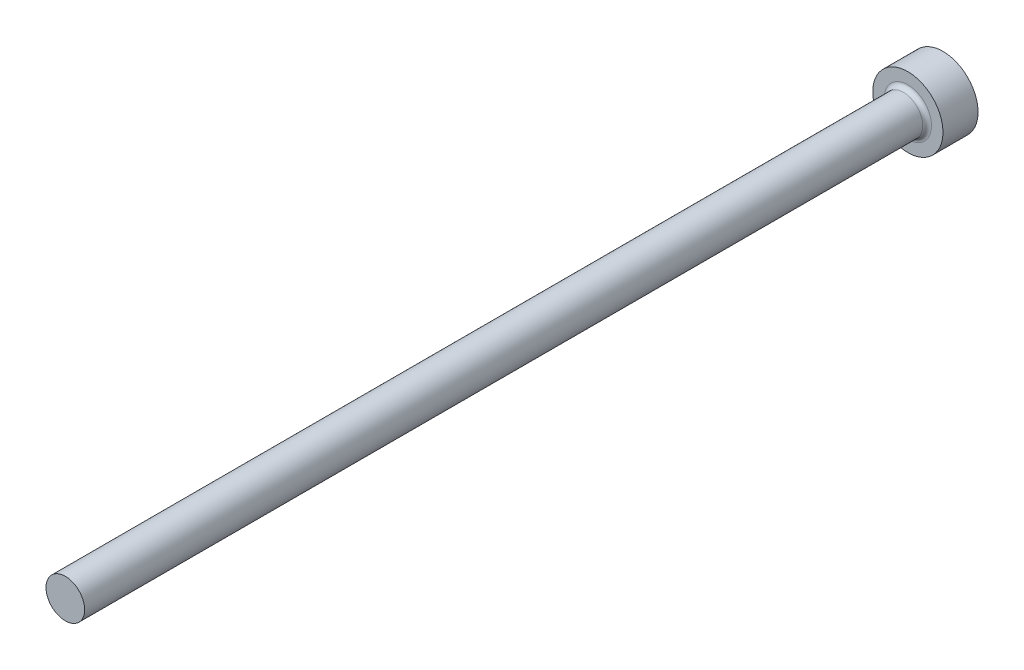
from build123d import *

# Parameters (mm, degrees)
FILLET1_R = 0.5


with BuildPart() as part:
    # FV → Revolve1 (revolve)
    with BuildSketch(Plane(origin=(0, 0, 0), x_dir=(1, 0, 0), z_dir=(0, 1, 0)), mode=Mode.PRIVATE) as revolve1_sk:
        Polygon((0, 0), (4, 0), (4, -4), (2.2, -4), (2.2, -100), (0, -100), align=None)
    revolve(revolve1_sk.sketch.rotate(Axis((0, 0, -9.033228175), (0, 0, 1)), 180), axis=Axis((0, 0, -9.033228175), (0, 0, 1)))

    # Fillet1
    fillet1_edges = [part.edges().sort_by_distance(p)[0] for p in [
        (2.2, 0, 4),
    ]]
    fillet(fillet1_edges, radius=FILLET1_R)


solid = part.part
